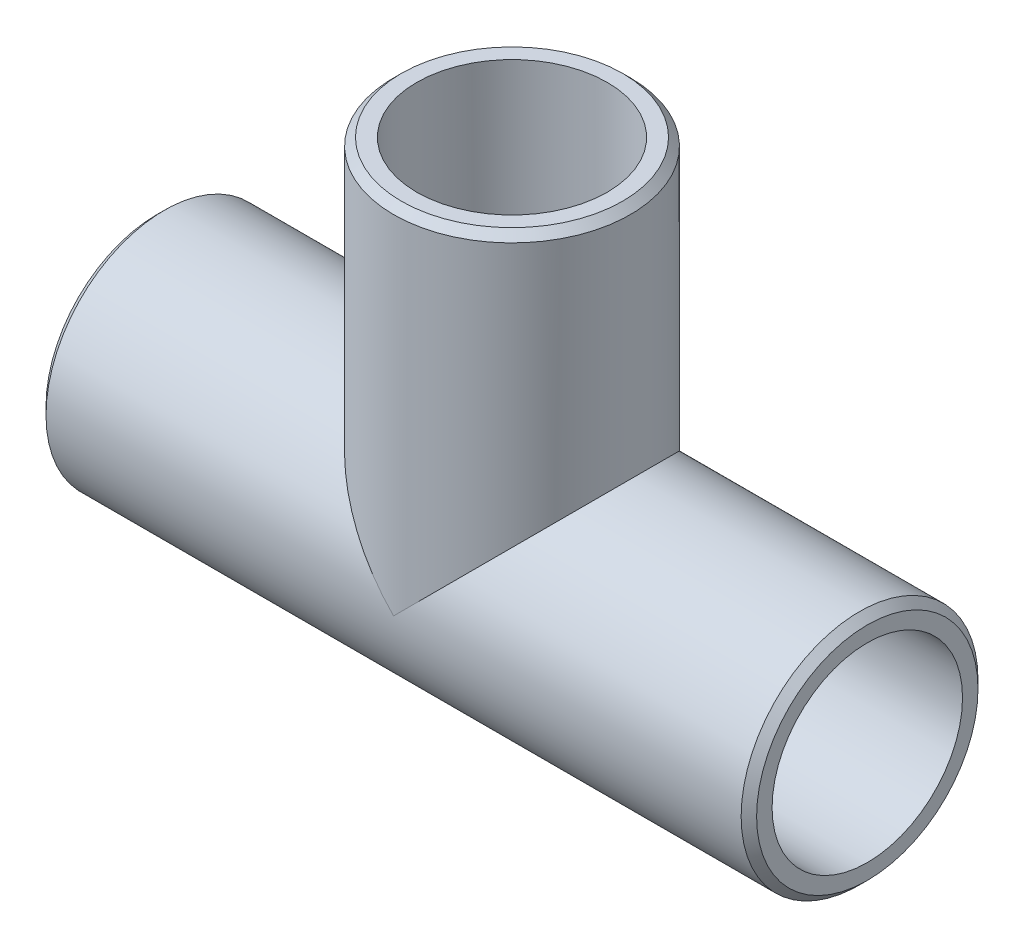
ISO-10303-21;
HEADER;
FILE_DESCRIPTION(('STEP AP214'),'2;1');
FILE_NAME('part.step','',(''),(''),'','','');
FILE_SCHEMA(('AUTOMOTIVE_DESIGN { 1 0 10303 214 1 1 1 1 }'));
ENDSEC;
DATA;
#1=APPLICATION_CONTEXT('core data for automotive mechanical design processes');
#2=APPLICATION_PROTOCOL_DEFINITION('international standard','automotive_design',2000,#1);
#3=PRODUCT_CONTEXT('',#1,'mechanical');
#4=PRODUCT('Part','Part','',(#3));
#5=PRODUCT_RELATED_PRODUCT_CATEGORY('part','',(#4));
#6=PRODUCT_DEFINITION_FORMATION('','',#4);
#7=PRODUCT_DEFINITION_CONTEXT('part definition',#1,'design');
#8=PRODUCT_DEFINITION('design','',#6,#7);
#9=PRODUCT_DEFINITION_SHAPE('','',#8);
#10=(LENGTH_UNIT() NAMED_UNIT(*) SI_UNIT(.MILLI.,.METRE.));
#11=(NAMED_UNIT(*) PLANE_ANGLE_UNIT() SI_UNIT($,.RADIAN.));
#12=(NAMED_UNIT(*) SI_UNIT($,.STERADIAN.) SOLID_ANGLE_UNIT());
#13=UNCERTAINTY_MEASURE_WITH_UNIT(LENGTH_MEASURE(1.E-05),#10,'distance_accuracy_value','');
#14=(GEOMETRIC_REPRESENTATION_CONTEXT(3) GLOBAL_UNCERTAINTY_ASSIGNED_CONTEXT((#13)) GLOBAL_UNIT_ASSIGNED_CONTEXT((#10,
#11,#12)) REPRESENTATION_CONTEXT('',''));
#15=CARTESIAN_POINT('',(0.,0.,0.));
#16=DIRECTION('',(0.,0.,1.));
#17=DIRECTION('',(1.,0.,0.));
#18=AXIS2_PLACEMENT_3D('',#15,#16,#17);
#19=CARTESIAN_POINT('',(-19.05,0.,0.));
#20=DIRECTION('',(-1.,0.,0.));
#21=DIRECTION('',(0.,0.,-1.));
#22=AXIS2_PLACEMENT_3D('',#19,#20,#21);
#23=PLANE('',#22);
#24=CARTESIAN_POINT('',(-19.05,0.,0.));
#25=DIRECTION('',(-1.,0.,0.));
#26=DIRECTION('',(0.,0.,1.));
#27=AXIS2_PLACEMENT_3D('',#24,#25,#26);
#28=CIRCLE('',#27,5.93513333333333);
#29=CARTESIAN_POINT('',(-19.05,0.,5.93513333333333));
#30=VERTEX_POINT('',#29);
#31=EDGE_CURVE('E39',#30,#30,#28,.T.);
#32=ORIENTED_EDGE('',*,*,#31,.T.);
#33=EDGE_LOOP('',(#32));
#34=FACE_BOUND('',#33,.T.);
#35=CARTESIAN_POINT('',(-19.05,0.,0.));
#36=DIRECTION('',(-1.,0.,0.));
#37=DIRECTION('',(0.,0.,1.));
#38=AXIS2_PLACEMENT_3D('',#35,#36,#37);
#39=CIRCLE('',#38,5.1054);
#40=CARTESIAN_POINT('',(-19.05,0.,5.1054));
#41=VERTEX_POINT('',#40);
#42=EDGE_CURVE('E66',#41,#41,#39,.F.);
#43=ORIENTED_EDGE('',*,*,#42,.T.);
#44=EDGE_LOOP('',(#43));
#45=FACE_BOUND('',#44,.T.);
#46=ADVANCED_FACE('F31',(#34,#45),#23,.T.);
#47=CARTESIAN_POINT('',(19.05,0.,0.));
#48=DIRECTION('',(-1.,0.,0.));
#49=DIRECTION('',(0.,0.,1.));
#50=AXIS2_PLACEMENT_3D('',#47,#48,#49);
#51=CYLINDRICAL_SURFACE('',#50,6.35);
#52=CARTESIAN_POINT('',(-18.6351333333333,0.,0.));
#53=DIRECTION('',(-1.,0.,0.));
#54=DIRECTION('',(0.,0.,1.));
#55=AXIS2_PLACEMENT_3D('',#52,#53,#54);
#56=CIRCLE('',#55,6.35);
#57=CARTESIAN_POINT('',(-18.6351333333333,0.,6.35));
#58=VERTEX_POINT('',#57);
#59=EDGE_CURVE('E85',#58,#58,#56,.F.);
#60=ORIENTED_EDGE('',*,*,#59,.T.);
#61=EDGE_LOOP('',(#60));
#62=FACE_BOUND('',#61,.T.);
#63=CARTESIAN_POINT('',(18.6351333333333,0.,0.));
#64=DIRECTION('',(1.,0.,0.));
#65=DIRECTION('',(0.,0.,-1.));
#66=AXIS2_PLACEMENT_3D('',#63,#64,#65);
#67=CIRCLE('',#66,6.35);
#68=CARTESIAN_POINT('',(18.6351333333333,0.,6.35));
#69=VERTEX_POINT('',#68);
#70=EDGE_CURVE('E82',#69,#69,#67,.F.);
#71=ORIENTED_EDGE('',*,*,#70,.T.);
#72=EDGE_LOOP('',(#71));
#73=FACE_BOUND('',#72,.T.);
#74=CARTESIAN_POINT('',(0.,0.,0.));
#75=DIRECTION('',(-0.707106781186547,-0.707106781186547,0.));
#76=DIRECTION('',(-0.707106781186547,0.707106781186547,0.));
#77=AXIS2_PLACEMENT_3D('',#74,#75,#76);
#78=ELLIPSE('',#77,8.98025612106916,6.35);
#79=CARTESIAN_POINT('',(0.,0.,-6.35));
#80=VERTEX_POINT('',#79);
#81=CARTESIAN_POINT('',(0.,0.,6.35));
#82=VERTEX_POINT('',#81);
#83=EDGE_CURVE('E48',#80,#82,#78,.F.);
#84=ORIENTED_EDGE('',*,*,#83,.F.);
#85=CARTESIAN_POINT('',(0.,0.,0.));
#86=DIRECTION('',(-0.707106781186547,0.707106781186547,0.));
#87=DIRECTION('',(-0.707106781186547,-0.707106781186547,0.));
#88=AXIS2_PLACEMENT_3D('',#85,#86,#87);
#89=ELLIPSE('',#88,8.98025612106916,6.35);
#90=EDGE_CURVE('E45',#82,#80,#89,.T.);
#91=ORIENTED_EDGE('',*,*,#90,.F.);
#92=EDGE_LOOP('',(#84,#91));
#93=FACE_BOUND('',#92,.T.);
#94=ADVANCED_FACE('F98',(#62,#73,#93),#51,.T.);
#95=CARTESIAN_POINT('',(19.05,0.,0.));
#96=DIRECTION('',(1.,0.,0.));
#97=DIRECTION('',(0.,0.,-1.));
#98=AXIS2_PLACEMENT_3D('',#95,#96,#97);
#99=PLANE('',#98);
#100=CARTESIAN_POINT('',(19.05,0.,0.));
#101=DIRECTION('',(1.,0.,0.));
#102=DIRECTION('',(0.,0.,-1.));
#103=AXIS2_PLACEMENT_3D('',#100,#101,#102);
#104=CIRCLE('',#103,5.93513333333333);
#105=CARTESIAN_POINT('',(19.05,0.,5.93513333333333));
#106=VERTEX_POINT('',#105);
#107=EDGE_CURVE('E11',#106,#106,#104,.T.);
#108=ORIENTED_EDGE('',*,*,#107,.T.);
#109=EDGE_LOOP('',(#108));
#110=FACE_BOUND('',#109,.T.);
#111=CARTESIAN_POINT('',(19.05,0.,0.));
#112=DIRECTION('',(1.,0.,0.));
#113=DIRECTION('',(0.,0.,-1.));
#114=AXIS2_PLACEMENT_3D('',#111,#112,#113);
#115=CIRCLE('',#114,5.1054);
#116=CARTESIAN_POINT('',(19.05,0.,-5.1054));
#117=VERTEX_POINT('',#116);
#118=EDGE_CURVE('E63',#117,#117,#115,.T.);
#119=ORIENTED_EDGE('',*,*,#118,.F.);
#120=EDGE_LOOP('',(#119));
#121=FACE_BOUND('',#120,.T.);
#122=ADVANCED_FACE('F101',(#110,#121),#99,.T.);
#123=CARTESIAN_POINT('',(0.,19.05,0.));
#124=DIRECTION('',(0.,-1.,0.));
#125=DIRECTION('',(0.,0.,-1.));
#126=AXIS2_PLACEMENT_3D('',#123,#124,#125);
#127=CYLINDRICAL_SURFACE('',#126,6.35);
#128=CARTESIAN_POINT('',(0.,18.6351333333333,0.));
#129=DIRECTION('',(0.,1.,0.));
#130=DIRECTION('',(0.,0.,1.));
#131=AXIS2_PLACEMENT_3D('',#128,#129,#130);
#132=CIRCLE('',#131,6.35);
#133=CARTESIAN_POINT('',(0.,18.6351333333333,-6.35));
#134=VERTEX_POINT('',#133);
#135=EDGE_CURVE('E79',#134,#134,#132,.F.);
#136=ORIENTED_EDGE('',*,*,#135,.T.);
#137=EDGE_LOOP('',(#136));
#138=FACE_BOUND('',#137,.T.);
#139=ORIENTED_EDGE('',*,*,#90,.T.);
#140=ORIENTED_EDGE('',*,*,#83,.T.);
#141=EDGE_LOOP('',(#139,#140));
#142=FACE_BOUND('',#141,.T.);
#143=ADVANCED_FACE('F111',(#138,#142),#127,.T.);
#144=CARTESIAN_POINT('',(0.,19.05,0.));
#145=DIRECTION('',(0.,1.,0.));
#146=DIRECTION('',(0.,0.,1.));
#147=AXIS2_PLACEMENT_3D('',#144,#145,#146);
#148=PLANE('',#147);
#149=CARTESIAN_POINT('',(0.,19.05,0.));
#150=DIRECTION('',(0.,1.,0.));
#151=DIRECTION('',(0.,0.,1.));
#152=AXIS2_PLACEMENT_3D('',#149,#150,#151);
#153=CIRCLE('',#152,5.93513333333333);
#154=CARTESIAN_POINT('',(0.,19.05,-5.93513333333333));
#155=VERTEX_POINT('',#154);
#156=EDGE_CURVE('E76',#155,#155,#153,.T.);
#157=ORIENTED_EDGE('',*,*,#156,.T.);
#158=EDGE_LOOP('',(#157));
#159=FACE_BOUND('',#158,.T.);
#160=CARTESIAN_POINT('',(0.,19.05,0.));
#161=DIRECTION('',(0.,1.,0.));
#162=DIRECTION('',(0.,0.,1.));
#163=AXIS2_PLACEMENT_3D('',#160,#161,#162);
#164=CIRCLE('',#163,5.1054);
#165=CARTESIAN_POINT('',(0.,19.05,5.1054));
#166=VERTEX_POINT('',#165);
#167=EDGE_CURVE('E70',#166,#166,#164,.T.);
#168=ORIENTED_EDGE('',*,*,#167,.F.);
#169=EDGE_LOOP('',(#168));
#170=FACE_BOUND('',#169,.T.);
#171=ADVANCED_FACE('F116',(#159,#170),#148,.T.);
#172=CARTESIAN_POINT('',(19.05,0.,0.));
#173=DIRECTION('',(-1.,0.,0.));
#174=DIRECTION('',(0.,0.,1.));
#175=AXIS2_PLACEMENT_3D('',#172,#173,#174);
#176=CYLINDRICAL_SURFACE('',#175,5.1054);
#177=ORIENTED_EDGE('',*,*,#42,.F.);
#178=EDGE_LOOP('',(#177));
#179=FACE_BOUND('',#178,.T.);
#180=ORIENTED_EDGE('',*,*,#118,.T.);
#181=EDGE_LOOP('',(#180));
#182=FACE_BOUND('',#181,.T.);
#183=CARTESIAN_POINT('',(0.,0.,0.));
#184=DIRECTION('',(-0.707106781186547,-0.707106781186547,0.));
#185=DIRECTION('',(-0.707106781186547,0.707106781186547,0.));
#186=AXIS2_PLACEMENT_3D('',#183,#184,#185);
#187=ELLIPSE('',#186,7.2201259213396,5.1054);
#188=CARTESIAN_POINT('',(0.,0.,-5.1054));
#189=VERTEX_POINT('',#188);
#190=CARTESIAN_POINT('',(0.,0.,5.1054));
#191=VERTEX_POINT('',#190);
#192=EDGE_CURVE('E56',#189,#191,#187,.F.);
#193=ORIENTED_EDGE('',*,*,#192,.T.);
#194=CARTESIAN_POINT('',(0.,0.,0.));
#195=DIRECTION('',(-0.707106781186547,0.707106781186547,0.));
#196=DIRECTION('',(-0.707106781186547,-0.707106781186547,0.));
#197=AXIS2_PLACEMENT_3D('',#194,#195,#196);
#198=ELLIPSE('',#197,7.2201259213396,5.1054);
#199=EDGE_CURVE('E59',#191,#189,#198,.T.);
#200=ORIENTED_EDGE('',*,*,#199,.T.);
#201=EDGE_LOOP('',(#193,#200));
#202=FACE_BOUND('',#201,.T.);
#203=ADVANCED_FACE('F62',(#179,#182,#202),#176,.F.);
#204=CARTESIAN_POINT('',(0.,19.05,0.));
#205=DIRECTION('',(0.,-1.,0.));
#206=DIRECTION('',(0.,0.,-1.));
#207=AXIS2_PLACEMENT_3D('',#204,#205,#206);
#208=CYLINDRICAL_SURFACE('',#207,5.1054);
#209=ORIENTED_EDGE('',*,*,#167,.T.);
#210=EDGE_LOOP('',(#209));
#211=FACE_BOUND('',#210,.T.);
#212=ORIENTED_EDGE('',*,*,#199,.F.);
#213=ORIENTED_EDGE('',*,*,#192,.F.);
#214=EDGE_LOOP('',(#212,#213));
#215=FACE_BOUND('',#214,.T.);
#216=ADVANCED_FACE('F58',(#211,#215),#208,.F.);
#217=CARTESIAN_POINT('',(0.,19.05,0.));
#218=DIRECTION('',(0.,-1.,0.));
#219=DIRECTION('',(0.,0.,-1.));
#220=AXIS2_PLACEMENT_3D('',#217,#218,#219);
#221=CONICAL_SURFACE('',#220,5.93513333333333,0.785398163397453);
#222=CARTESIAN_POINT('',(0.,18.6351333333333,-6.35));
#223=CARTESIAN_POINT('',(0.,18.6394548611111,-6.34567847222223));
#224=CARTESIAN_POINT('',(0.,18.6437763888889,-6.34135694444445));
#225=CARTESIAN_POINT('',(0.,18.6524194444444,-6.33271388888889));
#226=CARTESIAN_POINT('',(0.,18.6567409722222,-6.32839236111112));
#227=CARTESIAN_POINT('',(0.,18.6653840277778,-6.31974930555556));
#228=CARTESIAN_POINT('',(0.,18.6697055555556,-6.31542777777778));
#229=CARTESIAN_POINT('',(0.,18.6783486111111,-6.30678472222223));
#230=CARTESIAN_POINT('',(0.,18.6826701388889,-6.30246319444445));
#231=CARTESIAN_POINT('',(0.,18.6913131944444,-6.29382013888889));
#232=CARTESIAN_POINT('',(0.,18.6956347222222,-6.28949861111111));
#233=CARTESIAN_POINT('',(0.,18.7042777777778,-6.28085555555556));
#234=CARTESIAN_POINT('',(0.,18.7085993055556,-6.27653402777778));
#235=CARTESIAN_POINT('',(0.,18.7172423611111,-6.26789097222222));
#236=CARTESIAN_POINT('',(0.,18.7215638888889,-6.26356944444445));
#237=CARTESIAN_POINT('',(0.,18.7302069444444,-6.25492638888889));
#238=CARTESIAN_POINT('',(0.,18.7345284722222,-6.25060486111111));
#239=CARTESIAN_POINT('',(0.,18.7431715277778,-6.24196180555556));
#240=CARTESIAN_POINT('',(0.,18.7474930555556,-6.23764027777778));
#241=CARTESIAN_POINT('',(0.,18.7561361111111,-6.22899722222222));
#242=CARTESIAN_POINT('',(0.,18.7604576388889,-6.22467569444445));
#243=CARTESIAN_POINT('',(0.,18.7691006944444,-6.21603263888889));
#244=CARTESIAN_POINT('',(0.,18.7734222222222,-6.21171111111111));
#245=CARTESIAN_POINT('',(0.,18.7820652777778,-6.20306805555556));
#246=CARTESIAN_POINT('',(0.,18.7863868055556,-6.19874652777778));
#247=CARTESIAN_POINT('',(0.,18.7950298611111,-6.19010347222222));
#248=CARTESIAN_POINT('',(0.,18.7993513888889,-6.18578194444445));
#249=CARTESIAN_POINT('',(0.,18.8079944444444,-6.17713888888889));
#250=CARTESIAN_POINT('',(0.,18.8123159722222,-6.17281736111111));
#251=CARTESIAN_POINT('',(0.,18.8209590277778,-6.16417430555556));
#252=CARTESIAN_POINT('',(0.,18.8252805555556,-6.15985277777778));
#253=CARTESIAN_POINT('',(0.,18.8339236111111,-6.15120972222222));
#254=CARTESIAN_POINT('',(0.,18.8382451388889,-6.14688819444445));
#255=CARTESIAN_POINT('',(0.,18.8468881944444,-6.13824513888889));
#256=CARTESIAN_POINT('',(0.,18.8512097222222,-6.13392361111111));
#257=CARTESIAN_POINT('',(0.,18.8598527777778,-6.12528055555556));
#258=CARTESIAN_POINT('',(0.,18.8641743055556,-6.12095902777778));
#259=CARTESIAN_POINT('',(0.,18.8728173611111,-6.11231597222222));
#260=CARTESIAN_POINT('',(0.,18.8771388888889,-6.10799444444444));
#261=CARTESIAN_POINT('',(0.,18.8857819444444,-6.09935138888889));
#262=CARTESIAN_POINT('',(0.,18.8901034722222,-6.09502986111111));
#263=CARTESIAN_POINT('',(0.,18.8987465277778,-6.08638680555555));
#264=CARTESIAN_POINT('',(0.,18.9030680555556,-6.08206527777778));
#265=CARTESIAN_POINT('',(0.,18.9117111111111,-6.07342222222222));
#266=CARTESIAN_POINT('',(0.,18.9160326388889,-6.06910069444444));
#267=CARTESIAN_POINT('',(0.,18.9246756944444,-6.06045763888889));
#268=CARTESIAN_POINT('',(0.,18.9289972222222,-6.05613611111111));
#269=CARTESIAN_POINT('',(0.,18.9376402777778,-6.04749305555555));
#270=CARTESIAN_POINT('',(0.,18.9419618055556,-6.04317152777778));
#271=CARTESIAN_POINT('',(0.,18.9506048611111,-6.03452847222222));
#272=CARTESIAN_POINT('',(0.,18.9549263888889,-6.03020694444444));
#273=CARTESIAN_POINT('',(0.,18.9635694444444,-6.02156388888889));
#274=CARTESIAN_POINT('',(0.,18.9678909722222,-6.01724236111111));
#275=CARTESIAN_POINT('',(0.,18.9765340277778,-6.00859930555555));
#276=CARTESIAN_POINT('',(0.,18.9808555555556,-6.00427777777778));
#277=CARTESIAN_POINT('',(0.,18.9894986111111,-5.99563472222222));
#278=CARTESIAN_POINT('',(0.,18.9938201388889,-5.99131319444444));
#279=CARTESIAN_POINT('',(0.,19.0024631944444,-5.98267013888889));
#280=CARTESIAN_POINT('',(0.,19.0067847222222,-5.97834861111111));
#281=CARTESIAN_POINT('',(0.,19.0154277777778,-5.96970555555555));
#282=CARTESIAN_POINT('',(0.,19.0197493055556,-5.96538402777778));
#283=CARTESIAN_POINT('',(0.,19.0283923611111,-5.95674097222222));
#284=CARTESIAN_POINT('',(0.,19.0327138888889,-5.95241944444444));
#285=CARTESIAN_POINT('',(0.,19.0413569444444,-5.94377638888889));
#286=CARTESIAN_POINT('',(0.,19.0456784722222,-5.93945486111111));
#287=CARTESIAN_POINT('',(0.,19.05,-5.93513333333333));
#288=B_SPLINE_CURVE_WITH_KNOTS('',3,(#222,#223,#224,#225,#226,#227,#228,#229,#230,#231,#232,
#233,#234,#235,#236,#237,#238,#239,#240,#241,#242,#243,#244,#245,#246,#247,#248,#249,#250,#251,
#252,#253,#254,#255,#256,#257,#258,#259,#260,#261,#262,#263,#264,#265,#266,#267,#268,#269,#270,
#271,#272,#273,#274,#275,#276,#277,#278,#279,#280,#281,#282,#283,#284,#285,#286,#287),
.UNSPECIFIED.,.F.,.F.,(4,2,2,2,2,2,2,2,2,2,2,2,2,2,2,2,2,2,2,2,2,2,2,2,2,2,2,2,2,2,2,2,4),(0.,
0.0183346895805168,0.0366693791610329,0.0550040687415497,0.0733387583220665,0.0916734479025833,
0.1100081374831,0.128342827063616,0.146677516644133,0.16501220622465,0.183346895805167,
0.20168158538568,0.220016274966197,0.238350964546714,0.256685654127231,0.275020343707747,
0.293355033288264,0.31168972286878,0.330024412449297,0.348359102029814,0.366693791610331,
0.385028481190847,0.403363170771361,0.421697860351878,0.440032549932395,0.458367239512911,
0.476701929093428,0.495036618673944,0.513371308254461,0.531705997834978,0.550040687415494,
0.568375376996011,0.586710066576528),.UNSPECIFIED.);
#289=EDGE_CURVE('BSEAM95',#134,#155,#288,.T.);
#290=ORIENTED_EDGE('',*,*,#135,.F.);
#291=ORIENTED_EDGE('',*,*,#156,.F.);
#292=ORIENTED_EDGE('',*,*,#289,.T.);
#293=ORIENTED_EDGE('',*,*,#289,.F.);
#294=EDGE_LOOP('',(#290,#292,#291,#293));
#295=FACE_BOUND('',#294,.T.);
#296=ADVANCED_FACE('F95',(#295),#221,.T.);
#297=CARTESIAN_POINT('',(-18.6351333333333,0.,0.));
#298=DIRECTION('',(1.,0.,0.));
#299=DIRECTION('',(0.,0.,-1.));
#300=AXIS2_PLACEMENT_3D('',#297,#298,#299);
#301=CONICAL_SURFACE('',#300,6.35,0.785398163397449);
#302=ORIENTED_EDGE('',*,*,#31,.F.);
#303=EDGE_LOOP('',(#302));
#304=FACE_BOUND('',#303,.T.);
#305=ORIENTED_EDGE('',*,*,#59,.F.);
#306=EDGE_LOOP('',(#305));
#307=FACE_BOUND('',#306,.T.);
#308=ADVANCED_FACE('F92',(#304,#307),#301,.T.);
#309=CARTESIAN_POINT('',(19.05,0.,0.));
#310=DIRECTION('',(-1.,0.,0.));
#311=DIRECTION('',(0.,0.,1.));
#312=AXIS2_PLACEMENT_3D('',#309,#310,#311);
#313=CONICAL_SURFACE('',#312,5.93513333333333,0.785398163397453);
#314=CARTESIAN_POINT('',(18.6351333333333,0.,6.35));
#315=CARTESIAN_POINT('',(18.6394548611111,0.,6.34567847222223));
#316=CARTESIAN_POINT('',(18.6437763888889,0.,6.34135694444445));
#317=CARTESIAN_POINT('',(18.6524194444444,0.,6.33271388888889));
#318=CARTESIAN_POINT('',(18.6567409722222,0.,6.32839236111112));
#319=CARTESIAN_POINT('',(18.6653840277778,0.,6.31974930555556));
#320=CARTESIAN_POINT('',(18.6697055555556,0.,6.31542777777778));
#321=CARTESIAN_POINT('',(18.6783486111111,0.,6.30678472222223));
#322=CARTESIAN_POINT('',(18.6826701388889,0.,6.30246319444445));
#323=CARTESIAN_POINT('',(18.6913131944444,0.,6.29382013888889));
#324=CARTESIAN_POINT('',(18.6956347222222,0.,6.28949861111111));
#325=CARTESIAN_POINT('',(18.7042777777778,0.,6.28085555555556));
#326=CARTESIAN_POINT('',(18.7085993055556,0.,6.27653402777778));
#327=CARTESIAN_POINT('',(18.7172423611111,0.,6.26789097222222));
#328=CARTESIAN_POINT('',(18.7215638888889,0.,6.26356944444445));
#329=CARTESIAN_POINT('',(18.7302069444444,0.,6.25492638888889));
#330=CARTESIAN_POINT('',(18.7345284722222,0.,6.25060486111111));
#331=CARTESIAN_POINT('',(18.7431715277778,0.,6.24196180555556));
#332=CARTESIAN_POINT('',(18.7474930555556,0.,6.23764027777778));
#333=CARTESIAN_POINT('',(18.7561361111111,0.,6.22899722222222));
#334=CARTESIAN_POINT('',(18.7604576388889,0.,6.22467569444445));
#335=CARTESIAN_POINT('',(18.7691006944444,0.,6.21603263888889));
#336=CARTESIAN_POINT('',(18.7734222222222,0.,6.21171111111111));
#337=CARTESIAN_POINT('',(18.7820652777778,0.,6.20306805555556));
#338=CARTESIAN_POINT('',(18.7863868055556,0.,6.19874652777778));
#339=CARTESIAN_POINT('',(18.7950298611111,0.,6.19010347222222));
#340=CARTESIAN_POINT('',(18.7993513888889,0.,6.18578194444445));
#341=CARTESIAN_POINT('',(18.8079944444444,0.,6.17713888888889));
#342=CARTESIAN_POINT('',(18.8123159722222,0.,6.17281736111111));
#343=CARTESIAN_POINT('',(18.8209590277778,0.,6.16417430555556));
#344=CARTESIAN_POINT('',(18.8252805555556,0.,6.15985277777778));
#345=CARTESIAN_POINT('',(18.8339236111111,0.,6.15120972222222));
#346=CARTESIAN_POINT('',(18.8382451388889,0.,6.14688819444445));
#347=CARTESIAN_POINT('',(18.8468881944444,0.,6.13824513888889));
#348=CARTESIAN_POINT('',(18.8512097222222,0.,6.13392361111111));
#349=CARTESIAN_POINT('',(18.8598527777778,0.,6.12528055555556));
#350=CARTESIAN_POINT('',(18.8641743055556,0.,6.12095902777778));
#351=CARTESIAN_POINT('',(18.8728173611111,0.,6.11231597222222));
#352=CARTESIAN_POINT('',(18.8771388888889,0.,6.10799444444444));
#353=CARTESIAN_POINT('',(18.8857819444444,0.,6.09935138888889));
#354=CARTESIAN_POINT('',(18.8901034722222,0.,6.09502986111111));
#355=CARTESIAN_POINT('',(18.8987465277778,0.,6.08638680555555));
#356=CARTESIAN_POINT('',(18.9030680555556,0.,6.08206527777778));
#357=CARTESIAN_POINT('',(18.9117111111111,0.,6.07342222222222));
#358=CARTESIAN_POINT('',(18.9160326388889,0.,6.06910069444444));
#359=CARTESIAN_POINT('',(18.9246756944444,0.,6.06045763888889));
#360=CARTESIAN_POINT('',(18.9289972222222,0.,6.05613611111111));
#361=CARTESIAN_POINT('',(18.9376402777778,0.,6.04749305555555));
#362=CARTESIAN_POINT('',(18.9419618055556,0.,6.04317152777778));
#363=CARTESIAN_POINT('',(18.9506048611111,0.,6.03452847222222));
#364=CARTESIAN_POINT('',(18.9549263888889,0.,6.03020694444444));
#365=CARTESIAN_POINT('',(18.9635694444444,0.,6.02156388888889));
#366=CARTESIAN_POINT('',(18.9678909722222,0.,6.01724236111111));
#367=CARTESIAN_POINT('',(18.9765340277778,0.,6.00859930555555));
#368=CARTESIAN_POINT('',(18.9808555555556,0.,6.00427777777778));
#369=CARTESIAN_POINT('',(18.9894986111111,0.,5.99563472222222));
#370=CARTESIAN_POINT('',(18.9938201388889,0.,5.99131319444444));
#371=CARTESIAN_POINT('',(19.0024631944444,0.,5.98267013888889));
#372=CARTESIAN_POINT('',(19.0067847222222,0.,5.97834861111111));
#373=CARTESIAN_POINT('',(19.0154277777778,0.,5.96970555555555));
#374=CARTESIAN_POINT('',(19.0197493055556,0.,5.96538402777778));
#375=CARTESIAN_POINT('',(19.0283923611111,0.,5.95674097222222));
#376=CARTESIAN_POINT('',(19.0327138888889,0.,5.95241944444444));
#377=CARTESIAN_POINT('',(19.0413569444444,0.,5.94377638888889));
#378=CARTESIAN_POINT('',(19.0456784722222,0.,5.93945486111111));
#379=CARTESIAN_POINT('',(19.05,0.,5.93513333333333));
#380=B_SPLINE_CURVE_WITH_KNOTS('',3,(#314,#315,#316,#317,#318,#319,#320,#321,#322,#323,#324,
#325,#326,#327,#328,#329,#330,#331,#332,#333,#334,#335,#336,#337,#338,#339,#340,#341,#342,#343,
#344,#345,#346,#347,#348,#349,#350,#351,#352,#353,#354,#355,#356,#357,#358,#359,#360,#361,#362,
#363,#364,#365,#366,#367,#368,#369,#370,#371,#372,#373,#374,#375,#376,#377,#378,#379),
.UNSPECIFIED.,.F.,.F.,(4,2,2,2,2,2,2,2,2,2,2,2,2,2,2,2,2,2,2,2,2,2,2,2,2,2,2,2,2,2,2,2,4),(0.,
0.0183346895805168,0.0366693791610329,0.0550040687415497,0.0733387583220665,0.0916734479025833,
0.1100081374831,0.128342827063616,0.146677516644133,0.16501220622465,0.183346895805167,
0.20168158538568,0.220016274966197,0.238350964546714,0.256685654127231,0.275020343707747,
0.293355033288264,0.31168972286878,0.330024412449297,0.348359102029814,0.366693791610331,
0.385028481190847,0.403363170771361,0.421697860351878,0.440032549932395,0.458367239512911,
0.476701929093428,0.495036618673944,0.513371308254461,0.531705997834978,0.550040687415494,
0.568375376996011,0.586710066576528),.UNSPECIFIED.);
#381=EDGE_CURVE('BSEAM33',#69,#106,#380,.T.);
#382=ORIENTED_EDGE('',*,*,#70,.F.);
#383=ORIENTED_EDGE('',*,*,#107,.F.);
#384=ORIENTED_EDGE('',*,*,#381,.T.);
#385=ORIENTED_EDGE('',*,*,#381,.F.);
#386=EDGE_LOOP('',(#382,#384,#383,#385));
#387=FACE_BOUND('',#386,.T.);
#388=ADVANCED_FACE('F33',(#387),#313,.T.);
#389=CLOSED_SHELL('',(#46,#94,#122,#143,#171,#203,#216,#296,#308,#388));
#390=MANIFOLD_SOLID_BREP('B2',#389);
#391=ADVANCED_BREP_SHAPE_REPRESENTATION('',(#18,#390),#14);
#392=SHAPE_DEFINITION_REPRESENTATION(#9,#391);
ENDSEC;
END-ISO-10303-21;
